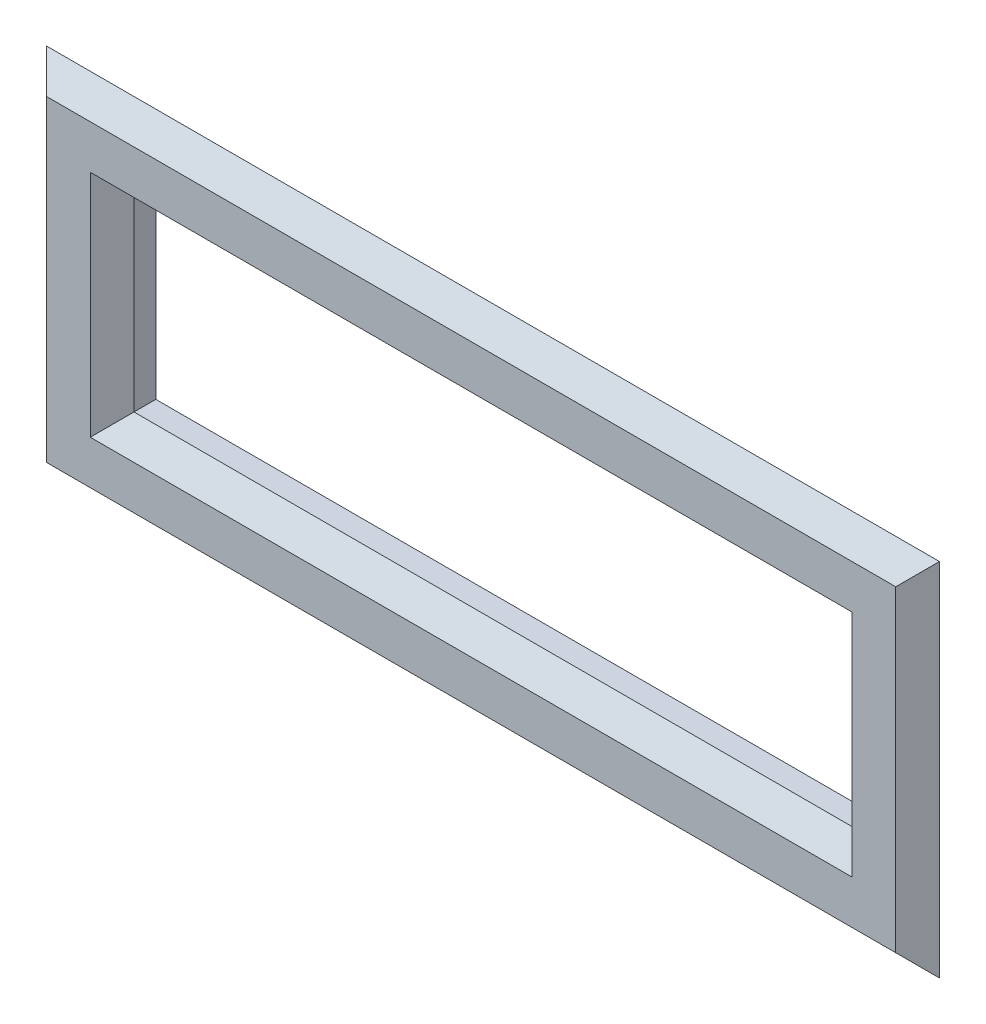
ISO-10303-21;
HEADER;
FILE_DESCRIPTION(('STEP AP214'),'2;1');
FILE_NAME('part.step','',(''),(''),'','','');
FILE_SCHEMA(('AUTOMOTIVE_DESIGN { 1 0 10303 214 1 1 1 1 }'));
ENDSEC;
DATA;
#1=APPLICATION_CONTEXT('core data for automotive mechanical design processes');
#2=APPLICATION_PROTOCOL_DEFINITION('international standard','automotive_design',2000,#1);
#3=PRODUCT_CONTEXT('',#1,'mechanical');
#4=PRODUCT('Part','Part','',(#3));
#5=PRODUCT_RELATED_PRODUCT_CATEGORY('part','',(#4));
#6=PRODUCT_DEFINITION_FORMATION('','',#4);
#7=PRODUCT_DEFINITION_CONTEXT('part definition',#1,'design');
#8=PRODUCT_DEFINITION('design','',#6,#7);
#9=PRODUCT_DEFINITION_SHAPE('','',#8);
#10=(LENGTH_UNIT() NAMED_UNIT(*) SI_UNIT(.MILLI.,.METRE.));
#11=(NAMED_UNIT(*) PLANE_ANGLE_UNIT() SI_UNIT($,.RADIAN.));
#12=(NAMED_UNIT(*) SI_UNIT($,.STERADIAN.) SOLID_ANGLE_UNIT());
#13=UNCERTAINTY_MEASURE_WITH_UNIT(LENGTH_MEASURE(1.E-05),#10,'distance_accuracy_value','');
#14=(GEOMETRIC_REPRESENTATION_CONTEXT(3) GLOBAL_UNCERTAINTY_ASSIGNED_CONTEXT((#13)) GLOBAL_UNIT_ASSIGNED_CONTEXT((#10,
#11,#12)) REPRESENTATION_CONTEXT('',''));
#15=CARTESIAN_POINT('',(0.,0.,0.));
#16=DIRECTION('',(0.,0.,1.));
#17=DIRECTION('',(1.,0.,0.));
#18=AXIS2_PLACEMENT_3D('',#15,#16,#17);
#19=CARTESIAN_POINT('',(0.,0.,0.));
#20=DIRECTION('',(0.,0.,-1.));
#21=DIRECTION('',(-1.,0.,0.));
#22=AXIS2_PLACEMENT_3D('',#19,#20,#21);
#23=PLANE('',#22);
#24=DIRECTION('',(0.,1.,0.));
#25=VECTOR('',#24,1.);
#26=CARTESIAN_POINT('',(34.85,-10.5,0.));
#27=LINE('',#26,#25);
#28=CARTESIAN_POINT('',(34.85,-10.5,0.));
#29=VERTEX_POINT('',#28);
#30=CARTESIAN_POINT('',(34.85,10.5,0.));
#31=VERTEX_POINT('',#30);
#32=EDGE_CURVE('E262',#29,#31,#27,.T.);
#33=ORIENTED_EDGE('',*,*,#32,.F.);
#34=DIRECTION('',(1.,0.,0.));
#35=VECTOR('',#34,1.);
#36=CARTESIAN_POINT('',(-34.85,-10.5,0.));
#37=LINE('',#36,#35);
#38=CARTESIAN_POINT('',(-34.85,-10.5,0.));
#39=VERTEX_POINT('',#38);
#40=EDGE_CURVE('E267',#39,#29,#37,.T.);
#41=ORIENTED_EDGE('',*,*,#40,.F.);
#42=DIRECTION('',(0.,-1.,0.));
#43=VECTOR('',#42,1.);
#44=CARTESIAN_POINT('',(-34.85,-10.5,0.));
#45=LINE('',#44,#43);
#46=CARTESIAN_POINT('',(-34.85,10.5,0.));
#47=VERTEX_POINT('',#46);
#48=EDGE_CURVE('E281',#47,#39,#45,.T.);
#49=ORIENTED_EDGE('',*,*,#48,.F.);
#50=DIRECTION('',(-1.,0.,0.));
#51=VECTOR('',#50,1.);
#52=CARTESIAN_POINT('',(-34.85,10.5,0.));
#53=LINE('',#52,#51);
#54=EDGE_CURVE('E279',#31,#47,#53,.T.);
#55=ORIENTED_EDGE('',*,*,#54,.F.);
#56=EDGE_LOOP('',(#33,#41,#49,#55));
#57=FACE_BOUND('',#56,.T.);
#58=DIRECTION('',(1.,0.,0.));
#59=VECTOR('',#58,1.);
#60=CARTESIAN_POINT('',(-32.85,-8.5,0.));
#61=LINE('',#60,#59);
#62=CARTESIAN_POINT('',(-32.85,-8.5,0.));
#63=VERTEX_POINT('',#62);
#64=CARTESIAN_POINT('',(32.85,-8.5,0.));
#65=VERTEX_POINT('',#64);
#66=EDGE_CURVE('E252',#63,#65,#61,.T.);
#67=ORIENTED_EDGE('',*,*,#66,.T.);
#68=DIRECTION('',(0.,1.,0.));
#69=VECTOR('',#68,1.);
#70=CARTESIAN_POINT('',(32.85,-8.5,0.));
#71=LINE('',#70,#69);
#72=CARTESIAN_POINT('',(32.85,8.5,0.));
#73=VERTEX_POINT('',#72);
#74=EDGE_CURVE('E546',#65,#73,#71,.T.);
#75=ORIENTED_EDGE('',*,*,#74,.T.);
#76=DIRECTION('',(-1.,0.,0.));
#77=VECTOR('',#76,1.);
#78=CARTESIAN_POINT('',(-32.85,8.5,0.));
#79=LINE('',#78,#77);
#80=CARTESIAN_POINT('',(-32.85,8.5,0.));
#81=VERTEX_POINT('',#80);
#82=EDGE_CURVE('E549',#73,#81,#79,.T.);
#83=ORIENTED_EDGE('',*,*,#82,.T.);
#84=DIRECTION('',(0.,-1.,0.));
#85=VECTOR('',#84,1.);
#86=CARTESIAN_POINT('',(-32.85,-8.5,0.));
#87=LINE('',#86,#85);
#88=EDGE_CURVE('E551',#81,#63,#87,.T.);
#89=ORIENTED_EDGE('',*,*,#88,.T.);
#90=EDGE_LOOP('',(#67,#75,#83,#89));
#91=FACE_BOUND('',#90,.T.);
#92=ADVANCED_FACE('F65',(#57,#91),#23,.T.);
#93=CARTESIAN_POINT('',(34.85,-10.5,2.));
#94=DIRECTION('',(-1.,0.,0.));
#95=DIRECTION('',(0.,0.,1.));
#96=AXIS2_PLACEMENT_3D('',#93,#94,#95);
#97=PLANE('',#96);
#98=ORIENTED_EDGE('',*,*,#32,.T.);
#99=DIRECTION('',(0.,0.,-1.));
#100=VECTOR('',#99,1.);
#101=CARTESIAN_POINT('',(34.85,10.5,2.));
#102=LINE('',#101,#100);
#103=CARTESIAN_POINT('',(34.85,10.5,2.));
#104=VERTEX_POINT('',#103);
#105=EDGE_CURVE('E226',#104,#31,#102,.T.);
#106=ORIENTED_EDGE('',*,*,#105,.F.);
#107=DIRECTION('',(0.,1.,0.));
#108=VECTOR('',#107,1.);
#109=CARTESIAN_POINT('',(34.85,-10.5,2.));
#110=LINE('',#109,#108);
#111=CARTESIAN_POINT('',(34.85,-10.5,2.));
#112=VERTEX_POINT('',#111);
#113=EDGE_CURVE('E263',#112,#104,#110,.T.);
#114=ORIENTED_EDGE('',*,*,#113,.F.);
#115=DIRECTION('',(0.,0.,-1.));
#116=VECTOR('',#115,1.);
#117=CARTESIAN_POINT('',(34.85,-10.5,2.));
#118=LINE('',#117,#116);
#119=EDGE_CURVE('E276',#112,#29,#118,.T.);
#120=ORIENTED_EDGE('',*,*,#119,.T.);
#121=EDGE_LOOP('',(#98,#106,#114,#120));
#122=FACE_BOUND('',#121,.T.);
#123=ADVANCED_FACE('F297',(#122),#97,.F.);
#124=CARTESIAN_POINT('',(-34.85,10.5,2.));
#125=DIRECTION('',(0.,-1.,0.));
#126=DIRECTION('',(0.,0.,-1.));
#127=AXIS2_PLACEMENT_3D('',#124,#125,#126);
#128=PLANE('',#127);
#129=ORIENTED_EDGE('',*,*,#54,.T.);
#130=DIRECTION('',(0.,0.,-1.));
#131=VECTOR('',#130,1.);
#132=CARTESIAN_POINT('',(-34.85,10.5,2.));
#133=LINE('',#132,#131);
#134=CARTESIAN_POINT('',(-34.85,10.5,2.));
#135=VERTEX_POINT('',#134);
#136=EDGE_CURVE('E289',#135,#47,#133,.T.);
#137=ORIENTED_EDGE('',*,*,#136,.F.);
#138=DIRECTION('',(-1.,0.,0.));
#139=VECTOR('',#138,1.);
#140=CARTESIAN_POINT('',(-34.85,10.5,2.));
#141=LINE('',#140,#139);
#142=EDGE_CURVE('E266',#104,#135,#141,.T.);
#143=ORIENTED_EDGE('',*,*,#142,.F.);
#144=ORIENTED_EDGE('',*,*,#105,.T.);
#145=EDGE_LOOP('',(#129,#137,#143,#144));
#146=FACE_BOUND('',#145,.T.);
#147=ADVANCED_FACE('F294',(#146),#128,.F.);
#148=CARTESIAN_POINT('',(-34.85,-10.5,2.));
#149=DIRECTION('',(1.,0.,0.));
#150=DIRECTION('',(0.,0.,-1.));
#151=AXIS2_PLACEMENT_3D('',#148,#149,#150);
#152=PLANE('',#151);
#153=ORIENTED_EDGE('',*,*,#48,.T.);
#154=DIRECTION('',(0.,0.,-1.));
#155=VECTOR('',#154,1.);
#156=CARTESIAN_POINT('',(-34.85,-10.5,2.));
#157=LINE('',#156,#155);
#158=CARTESIAN_POINT('',(-34.85,-10.5,2.));
#159=VERTEX_POINT('',#158);
#160=EDGE_CURVE('E286',#159,#39,#157,.T.);
#161=ORIENTED_EDGE('',*,*,#160,.F.);
#162=DIRECTION('',(0.,-1.,0.));
#163=VECTOR('',#162,1.);
#164=CARTESIAN_POINT('',(-34.85,-10.5,2.));
#165=LINE('',#164,#163);
#166=EDGE_CURVE('E270',#135,#159,#165,.T.);
#167=ORIENTED_EDGE('',*,*,#166,.F.);
#168=ORIENTED_EDGE('',*,*,#136,.T.);
#169=EDGE_LOOP('',(#153,#161,#167,#168));
#170=FACE_BOUND('',#169,.T.);
#171=ADVANCED_FACE('F304',(#170),#152,.F.);
#172=CARTESIAN_POINT('',(-34.85,-10.5,2.));
#173=DIRECTION('',(0.,1.,0.));
#174=DIRECTION('',(-1.,0.,0.));
#175=AXIS2_PLACEMENT_3D('',#172,#173,#174);
#176=PLANE('',#175);
#177=ORIENTED_EDGE('',*,*,#40,.T.);
#178=ORIENTED_EDGE('',*,*,#119,.F.);
#179=DIRECTION('',(1.,0.,0.));
#180=VECTOR('',#179,1.);
#181=CARTESIAN_POINT('',(-34.85,-10.5,2.));
#182=LINE('',#181,#180);
#183=EDGE_CURVE('E273',#159,#112,#182,.T.);
#184=ORIENTED_EDGE('',*,*,#183,.F.);
#185=ORIENTED_EDGE('',*,*,#160,.T.);
#186=EDGE_LOOP('',(#177,#178,#184,#185));
#187=FACE_BOUND('',#186,.T.);
#188=ADVANCED_FACE('F308',(#187),#176,.F.);
#189=CARTESIAN_POINT('',(32.85,-8.5,2.));
#190=DIRECTION('',(-1.,0.,0.));
#191=DIRECTION('',(0.,0.,1.));
#192=AXIS2_PLACEMENT_3D('',#189,#190,#191);
#193=PLANE('',#192);
#194=DIRECTION('',(0.,0.,-1.));
#195=VECTOR('',#194,1.);
#196=CARTESIAN_POINT('',(32.85,-8.5,2.));
#197=LINE('',#196,#195);
#198=CARTESIAN_POINT('',(32.85,-8.5,1.99999999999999));
#199=VERTEX_POINT('',#198);
#200=EDGE_CURVE('E254',#199,#65,#197,.T.);
#201=ORIENTED_EDGE('',*,*,#200,.F.);
#202=DIRECTION('',(0.,1.,0.));
#203=VECTOR('',#202,1.);
#204=CARTESIAN_POINT('',(32.85,-8.5,1.99999999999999));
#205=LINE('',#204,#203);
#206=CARTESIAN_POINT('',(32.85,8.5,1.99999999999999));
#207=VERTEX_POINT('',#206);
#208=EDGE_CURVE('E75',#199,#207,#205,.T.);
#209=ORIENTED_EDGE('',*,*,#208,.T.);
#210=DIRECTION('',(0.,0.,-1.));
#211=VECTOR('',#210,1.);
#212=CARTESIAN_POINT('',(32.85,8.5,2.));
#213=LINE('',#212,#211);
#214=EDGE_CURVE('E256',#207,#73,#213,.T.);
#215=ORIENTED_EDGE('',*,*,#214,.T.);
#216=ORIENTED_EDGE('',*,*,#74,.F.);
#217=EDGE_LOOP('',(#201,#209,#215,#216));
#218=FACE_BOUND('',#217,.T.);
#219=ADVANCED_FACE('F328',(#218),#193,.T.);
#220=CARTESIAN_POINT('',(-32.85,8.5,2.));
#221=DIRECTION('',(0.,-1.,0.));
#222=DIRECTION('',(0.,0.,-1.));
#223=AXIS2_PLACEMENT_3D('',#220,#221,#222);
#224=PLANE('',#223);
#225=ORIENTED_EDGE('',*,*,#214,.F.);
#226=DIRECTION('',(-1.,0.,0.));
#227=VECTOR('',#226,1.);
#228=CARTESIAN_POINT('',(-32.85,8.5,1.99999999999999));
#229=LINE('',#228,#227);
#230=CARTESIAN_POINT('',(-32.85,8.5,1.99999999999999));
#231=VERTEX_POINT('',#230);
#232=EDGE_CURVE('E12',#207,#231,#229,.T.);
#233=ORIENTED_EDGE('',*,*,#232,.T.);
#234=DIRECTION('',(0.,0.,-1.));
#235=VECTOR('',#234,1.);
#236=CARTESIAN_POINT('',(-32.85,8.5,2.));
#237=LINE('',#236,#235);
#238=EDGE_CURVE('E248',#231,#81,#237,.T.);
#239=ORIENTED_EDGE('',*,*,#238,.T.);
#240=ORIENTED_EDGE('',*,*,#82,.F.);
#241=EDGE_LOOP('',(#225,#233,#239,#240));
#242=FACE_BOUND('',#241,.T.);
#243=ADVANCED_FACE('F424',(#242),#224,.T.);
#244=CARTESIAN_POINT('',(-32.85,-8.5,2.));
#245=DIRECTION('',(1.,0.,0.));
#246=DIRECTION('',(0.,0.,-1.));
#247=AXIS2_PLACEMENT_3D('',#244,#245,#246);
#248=PLANE('',#247);
#249=ORIENTED_EDGE('',*,*,#238,.F.);
#250=DIRECTION('',(0.,-1.,0.));
#251=VECTOR('',#250,1.);
#252=CARTESIAN_POINT('',(-32.85,-8.5,1.99999999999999));
#253=LINE('',#252,#251);
#254=CARTESIAN_POINT('',(-32.85,-8.5,1.99999999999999));
#255=VERTEX_POINT('',#254);
#256=EDGE_CURVE('E238',#231,#255,#253,.T.);
#257=ORIENTED_EDGE('',*,*,#256,.T.);
#258=DIRECTION('',(0.,0.,-1.));
#259=VECTOR('',#258,1.);
#260=CARTESIAN_POINT('',(-32.85,-8.5,2.));
#261=LINE('',#260,#259);
#262=EDGE_CURVE('E246',#255,#63,#261,.T.);
#263=ORIENTED_EDGE('',*,*,#262,.T.);
#264=ORIENTED_EDGE('',*,*,#88,.F.);
#265=EDGE_LOOP('',(#249,#257,#263,#264));
#266=FACE_BOUND('',#265,.T.);
#267=ADVANCED_FACE('F244',(#266),#248,.T.);
#268=CARTESIAN_POINT('',(-32.85,-8.5,2.));
#269=DIRECTION('',(0.,1.,0.));
#270=DIRECTION('',(0.,0.,1.));
#271=AXIS2_PLACEMENT_3D('',#268,#269,#270);
#272=PLANE('',#271);
#273=ORIENTED_EDGE('',*,*,#262,.F.);
#274=DIRECTION('',(1.,0.,0.));
#275=VECTOR('',#274,1.);
#276=CARTESIAN_POINT('',(-32.85,-8.5,1.99999999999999));
#277=LINE('',#276,#275);
#278=EDGE_CURVE('E90',#255,#199,#277,.T.);
#279=ORIENTED_EDGE('',*,*,#278,.T.);
#280=ORIENTED_EDGE('',*,*,#200,.T.);
#281=ORIENTED_EDGE('',*,*,#66,.F.);
#282=EDGE_LOOP('',(#273,#279,#280,#281));
#283=FACE_BOUND('',#282,.T.);
#284=ADVANCED_FACE('F250',(#283),#272,.T.);
#285=CARTESIAN_POINT('',(0.,0.,2.));
#286=DIRECTION('',(0.,0.,1.));
#287=DIRECTION('',(1.,0.,0.));
#288=AXIS2_PLACEMENT_3D('',#285,#286,#287);
#289=PLANE('',#288);
#290=DIRECTION('',(1.,0.,0.));
#291=VECTOR('',#290,1.);
#292=CARTESIAN_POINT('',(-40.85,16.5,2.));
#293=LINE('',#292,#291);
#294=CARTESIAN_POINT('',(-40.85,16.5,2.));
#295=VERTEX_POINT('',#294);
#296=CARTESIAN_POINT('',(40.85,16.5,2.));
#297=VERTEX_POINT('',#296);
#298=EDGE_CURVE('E168',#295,#297,#293,.T.);
#299=ORIENTED_EDGE('',*,*,#298,.T.);
#300=DIRECTION('',(0.,1.,0.));
#301=VECTOR('',#300,1.);
#302=CARTESIAN_POINT('',(40.85,-16.5,2.));
#303=LINE('',#302,#301);
#304=CARTESIAN_POINT('',(40.85,-16.5,2.));
#305=VERTEX_POINT('',#304);
#306=EDGE_CURVE('E172',#305,#297,#303,.T.);
#307=ORIENTED_EDGE('',*,*,#306,.F.);
#308=DIRECTION('',(1.,0.,0.));
#309=VECTOR('',#308,1.);
#310=CARTESIAN_POINT('',(-40.85,-16.5,2.));
#311=LINE('',#310,#309);
#312=CARTESIAN_POINT('',(-40.85,-16.5,2.));
#313=VERTEX_POINT('',#312);
#314=EDGE_CURVE('E189',#313,#305,#311,.T.);
#315=ORIENTED_EDGE('',*,*,#314,.F.);
#316=DIRECTION('',(0.,1.,0.));
#317=VECTOR('',#316,1.);
#318=CARTESIAN_POINT('',(-40.85,-16.5,2.));
#319=LINE('',#318,#317);
#320=EDGE_CURVE('E174',#313,#295,#319,.T.);
#321=ORIENTED_EDGE('',*,*,#320,.T.);
#322=EDGE_LOOP('',(#299,#307,#315,#321));
#323=FACE_BOUND('',#322,.T.);
#324=ORIENTED_EDGE('',*,*,#183,.T.);
#325=ORIENTED_EDGE('',*,*,#113,.T.);
#326=ORIENTED_EDGE('',*,*,#142,.T.);
#327=ORIENTED_EDGE('',*,*,#166,.T.);
#328=EDGE_LOOP('',(#324,#325,#326,#327));
#329=FACE_BOUND('',#328,.T.);
#330=ADVANCED_FACE('F170',(#323,#329),#289,.F.);
#331=CARTESIAN_POINT('',(0.,0.,4.));
#332=DIRECTION('',(0.,0.,1.));
#333=DIRECTION('',(1.,0.,0.));
#334=AXIS2_PLACEMENT_3D('',#331,#332,#333);
#335=PLANE('',#334);
#336=DIRECTION('',(1.,0.,0.));
#337=VECTOR('',#336,1.);
#338=CARTESIAN_POINT('',(40.85,-14.5,4.));
#339=LINE('',#338,#337);
#340=CARTESIAN_POINT('',(-38.85,-14.5,4.));
#341=VERTEX_POINT('',#340);
#342=CARTESIAN_POINT('',(38.85,-14.5,4.));
#343=VERTEX_POINT('',#342);
#344=EDGE_CURVE('E234',#341,#343,#339,.T.);
#345=ORIENTED_EDGE('',*,*,#344,.T.);
#346=DIRECTION('',(0.,1.,0.));
#347=VECTOR('',#346,1.);
#348=CARTESIAN_POINT('',(38.85,16.5,4.));
#349=LINE('',#348,#347);
#350=CARTESIAN_POINT('',(38.85,14.5,4.));
#351=VERTEX_POINT('',#350);
#352=EDGE_CURVE('E236',#343,#351,#349,.T.);
#353=ORIENTED_EDGE('',*,*,#352,.T.);
#354=DIRECTION('',(-1.,0.,0.));
#355=VECTOR('',#354,1.);
#356=CARTESIAN_POINT('',(0.,14.5,4.));
#357=LINE('',#356,#355);
#358=CARTESIAN_POINT('',(-38.85,14.5,4.));
#359=VERTEX_POINT('',#358);
#360=EDGE_CURVE('E192',#351,#359,#357,.T.);
#361=ORIENTED_EDGE('',*,*,#360,.T.);
#362=DIRECTION('',(0.,-1.,0.));
#363=VECTOR('',#362,1.);
#364=CARTESIAN_POINT('',(-38.85,0.,4.));
#365=LINE('',#364,#363);
#366=EDGE_CURVE('E232',#359,#341,#365,.T.);
#367=ORIENTED_EDGE('',*,*,#366,.T.);
#368=EDGE_LOOP('',(#345,#353,#361,#367));
#369=FACE_BOUND('',#368,.T.);
#370=DIRECTION('',(-1.,0.,0.));
#371=VECTOR('',#370,1.);
#372=CARTESIAN_POINT('',(0.,-10.5,4.));
#373=LINE('',#372,#371);
#374=CARTESIAN_POINT('',(34.85,-10.5,4.));
#375=VERTEX_POINT('',#374);
#376=CARTESIAN_POINT('',(-34.85,-10.5,4.));
#377=VERTEX_POINT('',#376);
#378=EDGE_CURVE('E222',#375,#377,#373,.T.);
#379=ORIENTED_EDGE('',*,*,#378,.T.);
#380=DIRECTION('',(0.,1.,0.));
#381=VECTOR('',#380,1.);
#382=CARTESIAN_POINT('',(-34.85,0.,4.));
#383=LINE('',#382,#381);
#384=CARTESIAN_POINT('',(-34.85,10.5,4.));
#385=VERTEX_POINT('',#384);
#386=EDGE_CURVE('E224',#377,#385,#383,.T.);
#387=ORIENTED_EDGE('',*,*,#386,.T.);
#388=DIRECTION('',(1.,0.,0.));
#389=VECTOR('',#388,1.);
#390=CARTESIAN_POINT('',(0.,10.5,4.));
#391=LINE('',#390,#389);
#392=CARTESIAN_POINT('',(34.85,10.5,4.));
#393=VERTEX_POINT('',#392);
#394=EDGE_CURVE('E214',#385,#393,#391,.T.);
#395=ORIENTED_EDGE('',*,*,#394,.T.);
#396=DIRECTION('',(0.,-1.,0.));
#397=VECTOR('',#396,1.);
#398=CARTESIAN_POINT('',(34.85,0.,4.));
#399=LINE('',#398,#397);
#400=EDGE_CURVE('E219',#393,#375,#399,.T.);
#401=ORIENTED_EDGE('',*,*,#400,.T.);
#402=EDGE_LOOP('',(#379,#387,#395,#401));
#403=FACE_BOUND('',#402,.T.);
#404=ADVANCED_FACE('F310',(#369,#403),#335,.T.);
#405=CARTESIAN_POINT('',(-40.85,-16.5,1.99999999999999));
#406=DIRECTION('',(0.707106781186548,0.,-0.707106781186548));
#407=DIRECTION('',(0.,1.,0.));
#408=AXIS2_PLACEMENT_3D('',#405,#406,#407);
#409=PLANE('',#408);
#410=DIRECTION('',(0.577350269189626,-0.577350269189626,0.577350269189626));
#411=VECTOR('',#410,1.);
#412=CARTESIAN_POINT('',(-40.85,16.5,1.99999999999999));
#413=LINE('',#412,#411);
#414=EDGE_CURVE('E195',#295,#359,#413,.T.);
#415=ORIENTED_EDGE('',*,*,#414,.F.);
#416=ORIENTED_EDGE('',*,*,#320,.F.);
#417=DIRECTION('',(-0.577350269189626,-0.577350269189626,-0.577350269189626));
#418=VECTOR('',#417,1.);
#419=CARTESIAN_POINT('',(-40.85,-16.5,1.99999999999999));
#420=LINE('',#419,#418);
#421=EDGE_CURVE('E179',#341,#313,#420,.T.);
#422=ORIENTED_EDGE('',*,*,#421,.F.);
#423=ORIENTED_EDGE('',*,*,#366,.F.);
#424=EDGE_LOOP('',(#415,#416,#422,#423));
#425=FACE_BOUND('',#424,.T.);
#426=ADVANCED_FACE('F316',(#425),#409,.F.);
#427=CARTESIAN_POINT('',(0.,-14.5,4.));
#428=DIRECTION('',(0.,-0.707106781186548,0.707106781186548));
#429=DIRECTION('',(-1.,0.,0.));
#430=AXIS2_PLACEMENT_3D('',#427,#428,#429);
#431=PLANE('',#430);
#432=ORIENTED_EDGE('',*,*,#421,.T.);
#433=ORIENTED_EDGE('',*,*,#314,.T.);
#434=DIRECTION('',(-0.577350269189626,0.577350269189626,0.577350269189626));
#435=VECTOR('',#434,1.);
#436=CARTESIAN_POINT('',(25.9,-1.55,16.95));
#437=LINE('',#436,#435);
#438=EDGE_CURVE('E187',#343,#305,#437,.F.);
#439=ORIENTED_EDGE('',*,*,#438,.F.);
#440=ORIENTED_EDGE('',*,*,#344,.F.);
#441=EDGE_LOOP('',(#432,#433,#439,#440));
#442=FACE_BOUND('',#441,.T.);
#443=ADVANCED_FACE('F347',(#442),#431,.T.);
#444=CARTESIAN_POINT('',(-40.85,16.5,1.99999999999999));
#445=DIRECTION('',(0.,-0.707106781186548,-0.707106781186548));
#446=DIRECTION('',(1.,0.,0.));
#447=AXIS2_PLACEMENT_3D('',#444,#445,#446);
#448=PLANE('',#447);
#449=ORIENTED_EDGE('',*,*,#414,.T.);
#450=ORIENTED_EDGE('',*,*,#360,.F.);
#451=DIRECTION('',(-0.577350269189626,-0.577350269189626,0.577350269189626));
#452=VECTOR('',#451,1.);
#453=CARTESIAN_POINT('',(13.6166666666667,-10.7333333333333,29.2333333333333));
#454=LINE('',#453,#452);
#455=EDGE_CURVE('E184',#297,#351,#454,.T.);
#456=ORIENTED_EDGE('',*,*,#455,.F.);
#457=ORIENTED_EDGE('',*,*,#298,.F.);
#458=EDGE_LOOP('',(#449,#450,#456,#457));
#459=FACE_BOUND('',#458,.T.);
#460=ADVANCED_FACE('F191',(#459),#448,.F.);
#461=CARTESIAN_POINT('',(38.85,0.,4.));
#462=DIRECTION('',(0.707106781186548,0.,0.707106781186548));
#463=DIRECTION('',(0.,-1.,0.));
#464=AXIS2_PLACEMENT_3D('',#461,#462,#463);
#465=PLANE('',#464);
#466=ORIENTED_EDGE('',*,*,#438,.T.);
#467=ORIENTED_EDGE('',*,*,#306,.T.);
#468=ORIENTED_EDGE('',*,*,#455,.T.);
#469=ORIENTED_EDGE('',*,*,#352,.F.);
#470=EDGE_LOOP('',(#466,#467,#468,#469));
#471=FACE_BOUND('',#470,.T.);
#472=ADVANCED_FACE('F182',(#471),#465,.T.);
#473=CARTESIAN_POINT('',(32.85,-8.5,1.99999999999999));
#474=DIRECTION('',(0.707106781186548,0.,-0.707106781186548));
#475=DIRECTION('',(0.,1.,0.));
#476=AXIS2_PLACEMENT_3D('',#473,#474,#475);
#477=PLANE('',#476);
#478=DIRECTION('',(0.577350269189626,0.577350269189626,0.577350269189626));
#479=VECTOR('',#478,1.);
#480=CARTESIAN_POINT('',(27.1833333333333,2.83333333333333,-3.66666666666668));
#481=LINE('',#480,#479);
#482=EDGE_CURVE('E198',#207,#393,#481,.T.);
#483=ORIENTED_EDGE('',*,*,#482,.F.);
#484=ORIENTED_EDGE('',*,*,#208,.F.);
#485=DIRECTION('',(0.577350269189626,-0.577350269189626,0.577350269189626));
#486=VECTOR('',#485,1.);
#487=CARTESIAN_POINT('',(10.95,13.4,-19.9));
#488=LINE('',#487,#486);
#489=EDGE_CURVE('E70',#375,#199,#488,.F.);
#490=ORIENTED_EDGE('',*,*,#489,.F.);
#491=ORIENTED_EDGE('',*,*,#400,.F.);
#492=EDGE_LOOP('',(#483,#484,#490,#491));
#493=FACE_BOUND('',#492,.T.);
#494=ADVANCED_FACE('F68',(#493),#477,.F.);
#495=CARTESIAN_POINT('',(-32.85,-8.5,1.99999999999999));
#496=DIRECTION('',(0.,-0.707106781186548,-0.707106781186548));
#497=DIRECTION('',(1.,0.,0.));
#498=AXIS2_PLACEMENT_3D('',#495,#496,#497);
#499=PLANE('',#498);
#500=ORIENTED_EDGE('',*,*,#489,.T.);
#501=ORIENTED_EDGE('',*,*,#278,.F.);
#502=DIRECTION('',(-0.577350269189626,-0.577350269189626,0.577350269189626));
#503=VECTOR('',#502,1.);
#504=CARTESIAN_POINT('',(-31.35,-7.00000000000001,0.499999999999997));
#505=LINE('',#504,#503);
#506=EDGE_CURVE('E206',#377,#255,#505,.F.);
#507=ORIENTED_EDGE('',*,*,#506,.F.);
#508=ORIENTED_EDGE('',*,*,#378,.F.);
#509=EDGE_LOOP('',(#500,#501,#507,#508));
#510=FACE_BOUND('',#509,.T.);
#511=ADVANCED_FACE('F370',(#510),#499,.F.);
#512=CARTESIAN_POINT('',(0.,10.5,4.));
#513=DIRECTION('',(0.,0.707106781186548,-0.707106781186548));
#514=DIRECTION('',(1.,0.,0.));
#515=AXIS2_PLACEMENT_3D('',#512,#513,#514);
#516=PLANE('',#515);
#517=ORIENTED_EDGE('',*,*,#482,.T.);
#518=ORIENTED_EDGE('',*,*,#394,.F.);
#519=DIRECTION('',(0.577350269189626,-0.577350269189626,-0.577350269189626));
#520=VECTOR('',#519,1.);
#521=CARTESIAN_POINT('',(-31.35,7.00000000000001,0.499999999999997));
#522=LINE('',#521,#520);
#523=EDGE_CURVE('E204',#231,#385,#522,.F.);
#524=ORIENTED_EDGE('',*,*,#523,.F.);
#525=ORIENTED_EDGE('',*,*,#232,.F.);
#526=EDGE_LOOP('',(#517,#518,#524,#525));
#527=FACE_BOUND('',#526,.T.);
#528=ADVANCED_FACE('F212',(#527),#516,.F.);
#529=CARTESIAN_POINT('',(-34.85,0.,4.));
#530=DIRECTION('',(-0.707106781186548,0.,-0.707106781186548));
#531=DIRECTION('',(0.,1.,0.));
#532=AXIS2_PLACEMENT_3D('',#529,#530,#531);
#533=PLANE('',#532);
#534=ORIENTED_EDGE('',*,*,#506,.T.);
#535=ORIENTED_EDGE('',*,*,#256,.F.);
#536=ORIENTED_EDGE('',*,*,#523,.T.);
#537=ORIENTED_EDGE('',*,*,#386,.F.);
#538=EDGE_LOOP('',(#534,#535,#536,#537));
#539=FACE_BOUND('',#538,.T.);
#540=ADVANCED_FACE('F360',(#539),#533,.F.);
#541=CLOSED_SHELL('',(#92,#123,#147,#171,#188,#219,#243,#267,#284,#330,#404,#426,#443,#460,#472,
#494,#511,#528,#540));
#542=MANIFOLD_SOLID_BREP('B2',#541);
#543=ADVANCED_BREP_SHAPE_REPRESENTATION('',(#18,#542),#14);
#544=SHAPE_DEFINITION_REPRESENTATION(#9,#543);
ENDSEC;
END-ISO-10303-21;
